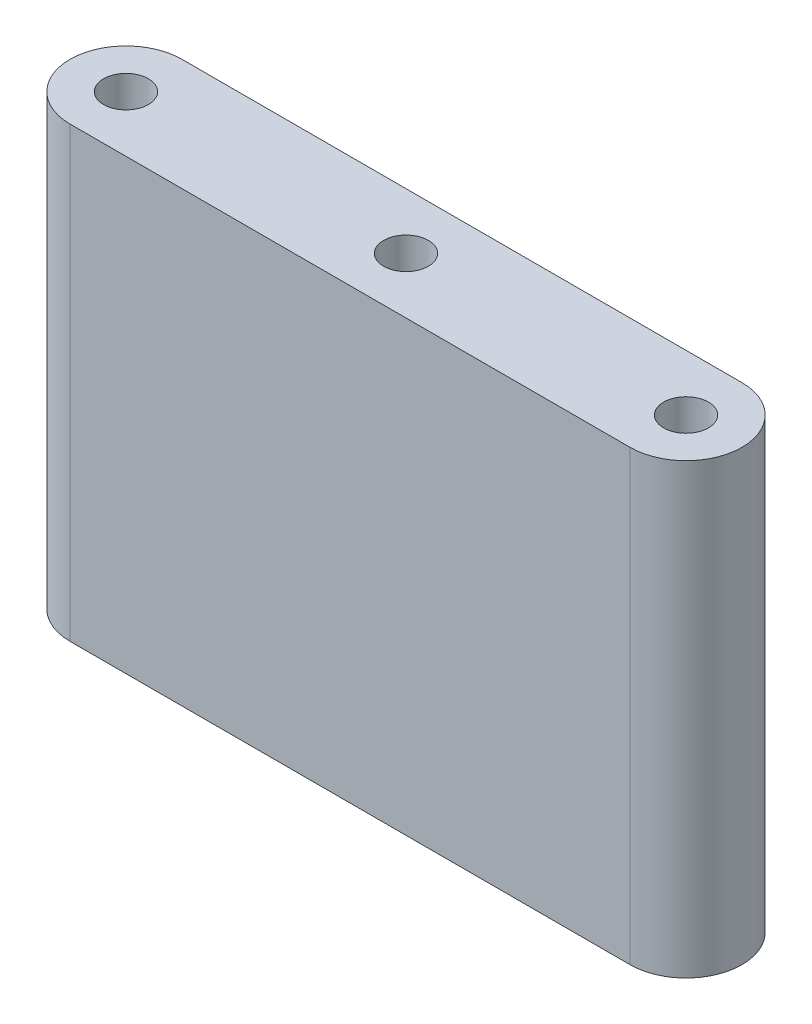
ISO-10303-21;
HEADER;
FILE_DESCRIPTION(('STEP AP214'),'2;1');
FILE_NAME('part.step','',(''),(''),'','','');
FILE_SCHEMA(('AUTOMOTIVE_DESIGN { 1 0 10303 214 1 1 1 1 }'));
ENDSEC;
DATA;
#1=APPLICATION_CONTEXT('core data for automotive mechanical design processes');
#2=APPLICATION_PROTOCOL_DEFINITION('international standard','automotive_design',2000,#1);
#3=PRODUCT_CONTEXT('',#1,'mechanical');
#4=PRODUCT('Part','Part','',(#3));
#5=PRODUCT_RELATED_PRODUCT_CATEGORY('part','',(#4));
#6=PRODUCT_DEFINITION_FORMATION('','',#4);
#7=PRODUCT_DEFINITION_CONTEXT('part definition',#1,'design');
#8=PRODUCT_DEFINITION('design','',#6,#7);
#9=PRODUCT_DEFINITION_SHAPE('','',#8);
#10=(LENGTH_UNIT() NAMED_UNIT(*) SI_UNIT(.MILLI.,.METRE.));
#11=(NAMED_UNIT(*) PLANE_ANGLE_UNIT() SI_UNIT($,.RADIAN.));
#12=(NAMED_UNIT(*) SI_UNIT($,.STERADIAN.) SOLID_ANGLE_UNIT());
#13=UNCERTAINTY_MEASURE_WITH_UNIT(LENGTH_MEASURE(1.E-05),#10,'distance_accuracy_value','');
#14=(GEOMETRIC_REPRESENTATION_CONTEXT(3) GLOBAL_UNCERTAINTY_ASSIGNED_CONTEXT((#13)) GLOBAL_UNIT_ASSIGNED_CONTEXT((#10,
#11,#12)) REPRESENTATION_CONTEXT('',''));
#15=CARTESIAN_POINT('',(0.,0.,0.));
#16=DIRECTION('',(0.,0.,1.));
#17=DIRECTION('',(1.,0.,0.));
#18=AXIS2_PLACEMENT_3D('',#15,#16,#17);
#19=CARTESIAN_POINT('',(0.,16.,0.));
#20=DIRECTION('',(0.,1.,0.));
#21=DIRECTION('',(0.,0.,1.));
#22=AXIS2_PLACEMENT_3D('',#19,#20,#21);
#23=PLANE('',#22);
#24=CARTESIAN_POINT('',(20.,16.,0.));
#25=DIRECTION('',(0.,1.,0.));
#26=DIRECTION('',(0.,0.,1.));
#27=AXIS2_PLACEMENT_3D('',#24,#25,#26);
#28=CIRCLE('',#27,1.6);
#29=CARTESIAN_POINT('',(20.,16.,1.6));
#30=VERTEX_POINT('',#29);
#31=EDGE_CURVE('E239',#30,#30,#28,.T.);
#32=ORIENTED_EDGE('',*,*,#31,.F.);
#33=EDGE_LOOP('',(#32));
#34=FACE_BOUND('',#33,.T.);
#35=CARTESIAN_POINT('',(0.,16.,0.));
#36=DIRECTION('',(0.,1.,0.));
#37=DIRECTION('',(0.,0.,1.));
#38=AXIS2_PLACEMENT_3D('',#35,#36,#37);
#39=CIRCLE('',#38,4.);
#40=CARTESIAN_POINT('',(0.,16.,-4.));
#41=VERTEX_POINT('',#40);
#42=CARTESIAN_POINT('',(0.,16.,4.));
#43=VERTEX_POINT('',#42);
#44=EDGE_CURVE('E139',#41,#43,#39,.T.);
#45=ORIENTED_EDGE('',*,*,#44,.T.);
#46=DIRECTION('',(1.,0.,0.));
#47=VECTOR('',#46,1.);
#48=CARTESIAN_POINT('',(0.,16.,4.));
#49=LINE('',#48,#47);
#50=CARTESIAN_POINT('',(40.,16.,4.));
#51=VERTEX_POINT('',#50);
#52=EDGE_CURVE('E129',#43,#51,#49,.T.);
#53=ORIENTED_EDGE('',*,*,#52,.T.);
#54=CARTESIAN_POINT('',(40.,16.,0.));
#55=DIRECTION('',(0.,1.,0.));
#56=DIRECTION('',(0.,0.,1.));
#57=AXIS2_PLACEMENT_3D('',#54,#55,#56);
#58=CIRCLE('',#57,4.);
#59=CARTESIAN_POINT('',(40.,16.,-4.));
#60=VERTEX_POINT('',#59);
#61=EDGE_CURVE('E138',#51,#60,#58,.T.);
#62=ORIENTED_EDGE('',*,*,#61,.T.);
#63=DIRECTION('',(-1.,0.,0.));
#64=VECTOR('',#63,1.);
#65=CARTESIAN_POINT('',(0.,16.,-4.));
#66=LINE('',#65,#64);
#67=EDGE_CURVE('E144',#60,#41,#66,.T.);
#68=ORIENTED_EDGE('',*,*,#67,.T.);
#69=EDGE_LOOP('',(#45,#53,#62,#68));
#70=FACE_BOUND('',#69,.T.);
#71=CARTESIAN_POINT('',(0.,16.,0.));
#72=DIRECTION('',(0.,1.,0.));
#73=DIRECTION('',(0.,0.,1.));
#74=AXIS2_PLACEMENT_3D('',#71,#72,#73);
#75=CIRCLE('',#74,1.6);
#76=CARTESIAN_POINT('',(0.,16.,1.6));
#77=VERTEX_POINT('',#76);
#78=EDGE_CURVE('E245',#77,#77,#75,.T.);
#79=ORIENTED_EDGE('',*,*,#78,.F.);
#80=EDGE_LOOP('',(#79));
#81=FACE_BOUND('',#80,.T.);
#82=CARTESIAN_POINT('',(40.,16.,0.));
#83=DIRECTION('',(0.,1.,0.));
#84=DIRECTION('',(0.,0.,1.));
#85=AXIS2_PLACEMENT_3D('',#82,#83,#84);
#86=CIRCLE('',#85,1.60000000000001);
#87=CARTESIAN_POINT('',(40.,16.,1.60000000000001));
#88=VERTEX_POINT('',#87);
#89=EDGE_CURVE('E233',#88,#88,#86,.T.);
#90=ORIENTED_EDGE('',*,*,#89,.F.);
#91=EDGE_LOOP('',(#90));
#92=FACE_BOUND('',#91,.T.);
#93=ADVANCED_FACE('F41',(#34,#70,#81,#92),#23,.T.);
#94=CARTESIAN_POINT('',(0.,-16.,0.));
#95=DIRECTION('',(0.,1.,0.));
#96=DIRECTION('',(0.,0.,1.));
#97=AXIS2_PLACEMENT_3D('',#94,#95,#96);
#98=PLANE('',#97);
#99=DIRECTION('',(0.,0.,-1.));
#100=VECTOR('',#99,1.);
#101=CARTESIAN_POINT('',(-4.,-16.,-16.3992561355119));
#102=LINE('',#101,#100);
#103=CARTESIAN_POINT('',(-4.,-16.,0.));
#104=VERTEX_POINT('',#103);
#105=CARTESIAN_POINT('',(-4.,-16.,-16.));
#106=VERTEX_POINT('',#105);
#107=EDGE_CURVE('E222',#104,#106,#102,.T.);
#108=ORIENTED_EDGE('',*,*,#107,.T.);
#109=CARTESIAN_POINT('',(-1.,-16.,-16.));
#110=DIRECTION('',(0.,1.,0.));
#111=DIRECTION('',(0.,0.,1.));
#112=AXIS2_PLACEMENT_3D('',#109,#110,#111);
#113=CIRCLE('',#112,3.);
#114=CARTESIAN_POINT('',(-3.89557916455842,-16.,-16.7846153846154));
#115=VERTEX_POINT('',#114);
#116=EDGE_CURVE('E175',#106,#115,#113,.F.);
#117=ORIENTED_EDGE('',*,*,#116,.T.);
#118=DIRECTION('',(0.261538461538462,0.,-0.965193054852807));
#119=VECTOR('',#118,1.);
#120=CARTESIAN_POINT('',(-1.59527616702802,-16.,-25.2737548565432));
#121=LINE('',#120,#119);
#122=CARTESIAN_POINT('',(-2.19557916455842,-16.,-23.0583702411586));
#123=VERTEX_POINT('',#122);
#124=EDGE_CURVE('E224',#115,#123,#121,.T.);
#125=ORIENTED_EDGE('',*,*,#124,.T.);
#126=CARTESIAN_POINT('',(0.700000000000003,-16.,-22.2737548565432));
#127=DIRECTION('',(0.,1.,0.));
#128=DIRECTION('',(0.,0.,1.));
#129=AXIS2_PLACEMENT_3D('',#126,#127,#128);
#130=CIRCLE('',#129,3.);
#131=CARTESIAN_POINT('',(0.700000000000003,-16.,-25.2737548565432));
#132=VERTEX_POINT('',#131);
#133=EDGE_CURVE('E171',#123,#132,#130,.F.);
#134=ORIENTED_EDGE('',*,*,#133,.T.);
#135=CARTESIAN_POINT('',(0.700000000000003,-16.,-22.2737548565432));
#136=DIRECTION('',(0.,1.,0.));
#137=DIRECTION('',(0.,0.,1.));
#138=AXIS2_PLACEMENT_3D('',#135,#136,#137);
#139=CIRCLE('',#138,3.);
#140=CARTESIAN_POINT('',(3.44688052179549,-16.,-23.4798424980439));
#141=VERTEX_POINT('',#140);
#142=EDGE_CURVE('E173',#132,#141,#139,.F.);
#143=ORIENTED_EDGE('',*,*,#142,.T.);
#144=DIRECTION('',(0.402029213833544,0.,0.915626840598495));
#145=VECTOR('',#144,1.);
#146=CARTESIAN_POINT('',(2.65921775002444,-16.,-25.2737548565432));
#147=LINE('',#146,#145);
#148=CARTESIAN_POINT('',(11.212337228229,-16.,-5.79391235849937));
#149=VERTEX_POINT('',#148);
#150=EDGE_CURVE('E194',#141,#149,#147,.T.);
#151=ORIENTED_EDGE('',*,*,#150,.T.);
#152=CARTESIAN_POINT('',(13.9592177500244,-16.,-7.));
#153=DIRECTION('',(0.,1.,0.));
#154=DIRECTION('',(0.,0.,1.));
#155=AXIS2_PLACEMENT_3D('',#152,#153,#154);
#156=CIRCLE('',#155,3.);
#157=CARTESIAN_POINT('',(13.9592177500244,-16.,-4.));
#158=VERTEX_POINT('',#157);
#159=EDGE_CURVE('E50',#149,#158,#156,.T.);
#160=ORIENTED_EDGE('',*,*,#159,.T.);
#161=DIRECTION('',(-1.,0.,0.));
#162=VECTOR('',#161,1.);
#163=CARTESIAN_POINT('',(0.,-16.,-4.));
#164=LINE('',#163,#162);
#165=CARTESIAN_POINT('',(40.,-16.,-4.));
#166=VERTEX_POINT('',#165);
#167=EDGE_CURVE('E148',#166,#158,#164,.T.);
#168=ORIENTED_EDGE('',*,*,#167,.F.);
#169=CARTESIAN_POINT('',(40.,-16.,0.));
#170=DIRECTION('',(0.,1.,0.));
#171=DIRECTION('',(0.,0.,1.));
#172=AXIS2_PLACEMENT_3D('',#169,#170,#171);
#173=CIRCLE('',#172,4.);
#174=CARTESIAN_POINT('',(40.,-16.,4.));
#175=VERTEX_POINT('',#174);
#176=EDGE_CURVE('E203',#175,#166,#173,.T.);
#177=ORIENTED_EDGE('',*,*,#176,.F.);
#178=DIRECTION('',(1.,0.,0.));
#179=VECTOR('',#178,1.);
#180=CARTESIAN_POINT('',(0.,-16.,4.));
#181=LINE('',#180,#179);
#182=CARTESIAN_POINT('',(0.,-16.,4.));
#183=VERTEX_POINT('',#182);
#184=EDGE_CURVE('E254',#183,#175,#181,.T.);
#185=ORIENTED_EDGE('',*,*,#184,.F.);
#186=CARTESIAN_POINT('',(0.,-16.,0.));
#187=DIRECTION('',(0.,1.,0.));
#188=DIRECTION('',(0.,0.,1.));
#189=AXIS2_PLACEMENT_3D('',#186,#187,#188);
#190=CIRCLE('',#189,4.);
#191=EDGE_CURVE('E152',#104,#183,#190,.T.);
#192=ORIENTED_EDGE('',*,*,#191,.F.);
#193=EDGE_LOOP('',(#108,#117,#125,#134,#143,#151,#160,#168,#177,#185,#192));
#194=FACE_BOUND('',#193,.T.);
#195=CARTESIAN_POINT('',(0.,-16.,0.));
#196=DIRECTION('',(0.,1.,0.));
#197=DIRECTION('',(0.,0.,1.));
#198=AXIS2_PLACEMENT_3D('',#195,#196,#197);
#199=CIRCLE('',#198,1.6);
#200=CARTESIAN_POINT('',(0.,-16.,1.6));
#201=VERTEX_POINT('',#200);
#202=EDGE_CURVE('E242',#201,#201,#199,.T.);
#203=ORIENTED_EDGE('',*,*,#202,.T.);
#204=EDGE_LOOP('',(#203));
#205=FACE_BOUND('',#204,.T.);
#206=CARTESIAN_POINT('',(20.,-16.,0.));
#207=DIRECTION('',(0.,1.,0.));
#208=DIRECTION('',(0.,0.,1.));
#209=AXIS2_PLACEMENT_3D('',#206,#207,#208);
#210=CIRCLE('',#209,1.6);
#211=CARTESIAN_POINT('',(20.,-16.,1.6));
#212=VERTEX_POINT('',#211);
#213=EDGE_CURVE('E236',#212,#212,#210,.T.);
#214=ORIENTED_EDGE('',*,*,#213,.T.);
#215=EDGE_LOOP('',(#214));
#216=FACE_BOUND('',#215,.T.);
#217=CARTESIAN_POINT('',(40.,-16.,0.));
#218=DIRECTION('',(0.,1.,0.));
#219=DIRECTION('',(0.,0.,1.));
#220=AXIS2_PLACEMENT_3D('',#217,#218,#219);
#221=CIRCLE('',#220,1.60000000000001);
#222=CARTESIAN_POINT('',(40.,-16.,1.60000000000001));
#223=VERTEX_POINT('',#222);
#224=EDGE_CURVE('E232',#223,#223,#221,.T.);
#225=ORIENTED_EDGE('',*,*,#224,.T.);
#226=EDGE_LOOP('',(#225));
#227=FACE_BOUND('',#226,.T.);
#228=CARTESIAN_POINT('',(0.700000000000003,-16.,-22.2737548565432));
#229=DIRECTION('',(0.,-1.,0.));
#230=DIRECTION('',(0.,0.,-1.));
#231=AXIS2_PLACEMENT_3D('',#228,#229,#230);
#232=CIRCLE('',#231,1.1);
#233=CARTESIAN_POINT('',(0.700000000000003,-16.,-23.3737548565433));
#234=VERTEX_POINT('',#233);
#235=EDGE_CURVE('E264',#234,#234,#232,.T.);
#236=ORIENTED_EDGE('',*,*,#235,.F.);
#237=EDGE_LOOP('',(#236));
#238=FACE_BOUND('',#237,.T.);
#239=CARTESIAN_POINT('',(-0.999999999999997,-16.,-16.));
#240=DIRECTION('',(0.,-1.,0.));
#241=DIRECTION('',(0.,0.,-1.));
#242=AXIS2_PLACEMENT_3D('',#239,#240,#241);
#243=CIRCLE('',#242,1.1);
#244=CARTESIAN_POINT('',(-0.999999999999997,-16.,-17.1));
#245=VERTEX_POINT('',#244);
#246=EDGE_CURVE('E270',#245,#245,#243,.T.);
#247=ORIENTED_EDGE('',*,*,#246,.F.);
#248=EDGE_LOOP('',(#247));
#249=FACE_BOUND('',#248,.T.);
#250=ADVANCED_FACE('F190',(#194,#205,#216,#227,#238,#249),#98,.F.);
#251=CARTESIAN_POINT('',(0.,16.,0.));
#252=DIRECTION('',(0.,-1.,0.));
#253=DIRECTION('',(0.,0.,-1.));
#254=AXIS2_PLACEMENT_3D('',#251,#252,#253);
#255=CYLINDRICAL_SURFACE('',#254,4.);
#256=CARTESIAN_POINT('',(0.,-8.,0.));
#257=DIRECTION('',(0.,-1.,0.));
#258=DIRECTION('',(0.,0.,-1.));
#259=AXIS2_PLACEMENT_3D('',#256,#257,#258);
#260=CIRCLE('',#259,4.);
#261=CARTESIAN_POINT('',(-4.,-8.,0.));
#262=VERTEX_POINT('',#261);
#263=CARTESIAN_POINT('',(0.,-8.,-4.));
#264=VERTEX_POINT('',#263);
#265=EDGE_CURVE('E230',#262,#264,#260,.T.);
#266=ORIENTED_EDGE('',*,*,#265,.F.);
#267=DIRECTION('',(0.,-1.,0.));
#268=VECTOR('',#267,1.);
#269=CARTESIAN_POINT('',(-4.,-8.,0.));
#270=LINE('',#269,#268);
#271=EDGE_CURVE('E216',#262,#104,#270,.T.);
#272=ORIENTED_EDGE('',*,*,#271,.T.);
#273=ORIENTED_EDGE('',*,*,#191,.T.);
#274=DIRECTION('',(0.,-1.,0.));
#275=VECTOR('',#274,1.);
#276=CARTESIAN_POINT('',(0.,16.,4.));
#277=LINE('',#276,#275);
#278=EDGE_CURVE('E133',#43,#183,#277,.T.);
#279=ORIENTED_EDGE('',*,*,#278,.F.);
#280=ORIENTED_EDGE('',*,*,#44,.F.);
#281=DIRECTION('',(0.,-1.,0.));
#282=VECTOR('',#281,1.);
#283=CARTESIAN_POINT('',(0.,16.,-4.));
#284=LINE('',#283,#282);
#285=EDGE_CURVE('E252',#41,#264,#284,.T.);
#286=ORIENTED_EDGE('',*,*,#285,.T.);
#287=EDGE_LOOP('',(#266,#272,#273,#279,#280,#286));
#288=FACE_BOUND('',#287,.T.);
#289=ADVANCED_FACE('F150',(#288),#255,.T.);
#290=CARTESIAN_POINT('',(0.,16.,4.));
#291=DIRECTION('',(0.,0.,-1.));
#292=DIRECTION('',(-1.,0.,0.));
#293=AXIS2_PLACEMENT_3D('',#290,#291,#292);
#294=PLANE('',#293);
#295=ORIENTED_EDGE('',*,*,#184,.T.);
#296=DIRECTION('',(0.,-1.,0.));
#297=VECTOR('',#296,1.);
#298=CARTESIAN_POINT('',(40.,16.,4.));
#299=LINE('',#298,#297);
#300=EDGE_CURVE('E135',#51,#175,#299,.T.);
#301=ORIENTED_EDGE('',*,*,#300,.F.);
#302=ORIENTED_EDGE('',*,*,#52,.F.);
#303=ORIENTED_EDGE('',*,*,#278,.T.);
#304=EDGE_LOOP('',(#295,#301,#302,#303));
#305=FACE_BOUND('',#304,.T.);
#306=ADVANCED_FACE('F131',(#305),#294,.F.);
#307=CARTESIAN_POINT('',(40.,16.,0.));
#308=DIRECTION('',(0.,-1.,0.));
#309=DIRECTION('',(0.,0.,-1.));
#310=AXIS2_PLACEMENT_3D('',#307,#308,#309);
#311=CYLINDRICAL_SURFACE('',#310,4.);
#312=ORIENTED_EDGE('',*,*,#176,.T.);
#313=DIRECTION('',(0.,-1.,0.));
#314=VECTOR('',#313,1.);
#315=CARTESIAN_POINT('',(40.,16.,-4.));
#316=LINE('',#315,#314);
#317=EDGE_CURVE('E159',#60,#166,#316,.T.);
#318=ORIENTED_EDGE('',*,*,#317,.F.);
#319=ORIENTED_EDGE('',*,*,#61,.F.);
#320=ORIENTED_EDGE('',*,*,#300,.T.);
#321=EDGE_LOOP('',(#312,#318,#319,#320));
#322=FACE_BOUND('',#321,.T.);
#323=ADVANCED_FACE('F299',(#322),#311,.T.);
#324=CARTESIAN_POINT('',(0.,16.,-4.));
#325=DIRECTION('',(0.,0.,1.));
#326=DIRECTION('',(1.,0.,0.));
#327=AXIS2_PLACEMENT_3D('',#324,#325,#326);
#328=PLANE('',#327);
#329=ORIENTED_EDGE('',*,*,#167,.T.);
#330=DIRECTION('',(0.,-1.,0.));
#331=VECTOR('',#330,1.);
#332=CARTESIAN_POINT('',(13.9592177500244,16.,-4.));
#333=LINE('',#332,#331);
#334=CARTESIAN_POINT('',(13.9592177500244,-8.,-4.));
#335=VERTEX_POINT('',#334);
#336=EDGE_CURVE('E165',#158,#335,#333,.F.);
#337=ORIENTED_EDGE('',*,*,#336,.T.);
#338=DIRECTION('',(-1.,0.,0.));
#339=VECTOR('',#338,1.);
#340=CARTESIAN_POINT('',(12.,-8.,-4.));
#341=LINE('',#340,#339);
#342=EDGE_CURVE('E210',#335,#264,#341,.T.);
#343=ORIENTED_EDGE('',*,*,#342,.T.);
#344=ORIENTED_EDGE('',*,*,#285,.F.);
#345=ORIENTED_EDGE('',*,*,#67,.F.);
#346=ORIENTED_EDGE('',*,*,#317,.T.);
#347=EDGE_LOOP('',(#329,#337,#343,#344,#345,#346));
#348=FACE_BOUND('',#347,.T.);
#349=ADVANCED_FACE('F200',(#348),#328,.F.);
#350=CARTESIAN_POINT('',(0.,16.,0.));
#351=DIRECTION('',(0.,-1.,0.));
#352=DIRECTION('',(0.,0.,-1.));
#353=AXIS2_PLACEMENT_3D('',#350,#351,#352);
#354=CYLINDRICAL_SURFACE('',#353,1.6);
#355=ORIENTED_EDGE('',*,*,#78,.T.);
#356=EDGE_LOOP('',(#355));
#357=FACE_BOUND('',#356,.T.);
#358=ORIENTED_EDGE('',*,*,#202,.F.);
#359=EDGE_LOOP('',(#358));
#360=FACE_BOUND('',#359,.T.);
#361=ADVANCED_FACE('F298',(#357,#360),#354,.F.);
#362=CARTESIAN_POINT('',(20.,16.,0.));
#363=DIRECTION('',(0.,-1.,0.));
#364=DIRECTION('',(0.,0.,-1.));
#365=AXIS2_PLACEMENT_3D('',#362,#363,#364);
#366=CYLINDRICAL_SURFACE('',#365,1.6);
#367=ORIENTED_EDGE('',*,*,#31,.T.);
#368=EDGE_LOOP('',(#367));
#369=FACE_BOUND('',#368,.T.);
#370=ORIENTED_EDGE('',*,*,#213,.F.);
#371=EDGE_LOOP('',(#370));
#372=FACE_BOUND('',#371,.T.);
#373=ADVANCED_FACE('F341',(#369,#372),#366,.F.);
#374=CARTESIAN_POINT('',(40.,16.,0.));
#375=DIRECTION('',(0.,-1.,0.));
#376=DIRECTION('',(0.,0.,-1.));
#377=AXIS2_PLACEMENT_3D('',#374,#375,#376);
#378=CYLINDRICAL_SURFACE('',#377,1.60000000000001);
#379=ORIENTED_EDGE('',*,*,#89,.T.);
#380=EDGE_LOOP('',(#379));
#381=FACE_BOUND('',#380,.T.);
#382=ORIENTED_EDGE('',*,*,#224,.F.);
#383=EDGE_LOOP('',(#382));
#384=FACE_BOUND('',#383,.T.);
#385=ADVANCED_FACE('F335',(#381,#384),#378,.F.);
#386=CARTESIAN_POINT('',(0.,-8.,0.));
#387=DIRECTION('',(0.,-1.,0.));
#388=DIRECTION('',(0.,0.,-1.));
#389=AXIS2_PLACEMENT_3D('',#386,#387,#388);
#390=PLANE('',#389);
#391=CARTESIAN_POINT('',(-0.999999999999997,-8.,-16.));
#392=DIRECTION('',(0.,-1.,0.));
#393=DIRECTION('',(0.,0.,-1.));
#394=AXIS2_PLACEMENT_3D('',#391,#392,#393);
#395=CIRCLE('',#394,1.1);
#396=CARTESIAN_POINT('',(-0.999999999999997,-8.,-17.1));
#397=VERTEX_POINT('',#396);
#398=EDGE_CURVE('E267',#397,#397,#395,.T.);
#399=ORIENTED_EDGE('',*,*,#398,.T.);
#400=EDGE_LOOP('',(#399));
#401=FACE_BOUND('',#400,.T.);
#402=CARTESIAN_POINT('',(0.700000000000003,-8.,-22.2737548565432));
#403=DIRECTION('',(0.,-1.,0.));
#404=DIRECTION('',(0.,0.,-1.));
#405=AXIS2_PLACEMENT_3D('',#402,#403,#404);
#406=CIRCLE('',#405,1.1);
#407=CARTESIAN_POINT('',(0.700000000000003,-8.,-23.3737548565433));
#408=VERTEX_POINT('',#407);
#409=EDGE_CURVE('E225',#408,#408,#406,.T.);
#410=ORIENTED_EDGE('',*,*,#409,.T.);
#411=EDGE_LOOP('',(#410));
#412=FACE_BOUND('',#411,.T.);
#413=DIRECTION('',(0.261538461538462,0.,-0.965193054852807));
#414=VECTOR('',#413,1.);
#415=CARTESIAN_POINT('',(-1.59527616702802,-8.,-25.2737548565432));
#416=LINE('',#415,#414);
#417=CARTESIAN_POINT('',(-3.89557916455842,-8.,-16.7846153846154));
#418=VERTEX_POINT('',#417);
#419=CARTESIAN_POINT('',(-2.19557916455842,-8.,-23.0583702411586));
#420=VERTEX_POINT('',#419);
#421=EDGE_CURVE('E214',#418,#420,#416,.T.);
#422=ORIENTED_EDGE('',*,*,#421,.F.);
#423=CARTESIAN_POINT('',(-1.,-8.,-16.));
#424=DIRECTION('',(0.,-1.,0.));
#425=DIRECTION('',(0.,0.,-1.));
#426=AXIS2_PLACEMENT_3D('',#423,#424,#425);
#427=CIRCLE('',#426,3.);
#428=CARTESIAN_POINT('',(-4.,-8.,-16.));
#429=VERTEX_POINT('',#428);
#430=EDGE_CURVE('E183',#418,#429,#427,.F.);
#431=ORIENTED_EDGE('',*,*,#430,.T.);
#432=DIRECTION('',(0.,0.,-1.));
#433=VECTOR('',#432,1.);
#434=CARTESIAN_POINT('',(-4.,-8.,-16.3992561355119));
#435=LINE('',#434,#433);
#436=EDGE_CURVE('E218',#262,#429,#435,.T.);
#437=ORIENTED_EDGE('',*,*,#436,.F.);
#438=ORIENTED_EDGE('',*,*,#265,.T.);
#439=ORIENTED_EDGE('',*,*,#342,.F.);
#440=CARTESIAN_POINT('',(13.9592177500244,-8.,-7.));
#441=DIRECTION('',(0.,-1.,0.));
#442=DIRECTION('',(0.,0.,-1.));
#443=AXIS2_PLACEMENT_3D('',#440,#441,#442);
#444=CIRCLE('',#443,3.);
#445=CARTESIAN_POINT('',(11.212337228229,-8.,-5.79391235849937));
#446=VERTEX_POINT('',#445);
#447=EDGE_CURVE('E11',#335,#446,#444,.T.);
#448=ORIENTED_EDGE('',*,*,#447,.T.);
#449=DIRECTION('',(0.402029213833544,0.,0.915626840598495));
#450=VECTOR('',#449,1.);
#451=CARTESIAN_POINT('',(2.65921775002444,-8.,-25.2737548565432));
#452=LINE('',#451,#450);
#453=CARTESIAN_POINT('',(3.44688052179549,-8.,-23.4798424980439));
#454=VERTEX_POINT('',#453);
#455=EDGE_CURVE('E208',#454,#446,#452,.T.);
#456=ORIENTED_EDGE('',*,*,#455,.F.);
#457=CARTESIAN_POINT('',(0.700000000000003,-8.,-22.2737548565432));
#458=DIRECTION('',(0.,-1.,0.));
#459=DIRECTION('',(0.,0.,-1.));
#460=AXIS2_PLACEMENT_3D('',#457,#458,#459);
#461=CIRCLE('',#460,3.);
#462=CARTESIAN_POINT('',(0.700000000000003,-8.,-25.2737548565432));
#463=VERTEX_POINT('',#462);
#464=EDGE_CURVE('E57',#454,#463,#461,.F.);
#465=ORIENTED_EDGE('',*,*,#464,.T.);
#466=CARTESIAN_POINT('',(0.700000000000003,-8.,-22.2737548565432));
#467=DIRECTION('',(0.,-1.,0.));
#468=DIRECTION('',(0.,0.,-1.));
#469=AXIS2_PLACEMENT_3D('',#466,#467,#468);
#470=CIRCLE('',#469,3.);
#471=EDGE_CURVE('E61',#463,#420,#470,.F.);
#472=ORIENTED_EDGE('',*,*,#471,.T.);
#473=EDGE_LOOP('',(#422,#431,#437,#438,#439,#448,#456,#465,#472));
#474=FACE_BOUND('',#473,.T.);
#475=ADVANCED_FACE('F207',(#401,#412,#474),#390,.F.);
#476=CARTESIAN_POINT('',(-4.,-8.,-16.3992561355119));
#477=DIRECTION('',(-1.,0.,0.));
#478=DIRECTION('',(0.,0.,1.));
#479=AXIS2_PLACEMENT_3D('',#476,#477,#478);
#480=PLANE('',#479);
#481=ORIENTED_EDGE('',*,*,#436,.T.);
#482=DIRECTION('',(0.,-1.,0.));
#483=VECTOR('',#482,1.);
#484=CARTESIAN_POINT('',(-4.,-8.,-16.));
#485=LINE('',#484,#483);
#486=EDGE_CURVE('E168',#429,#106,#485,.T.);
#487=ORIENTED_EDGE('',*,*,#486,.T.);
#488=ORIENTED_EDGE('',*,*,#107,.F.);
#489=ORIENTED_EDGE('',*,*,#271,.F.);
#490=EDGE_LOOP('',(#481,#487,#488,#489));
#491=FACE_BOUND('',#490,.T.);
#492=ADVANCED_FACE('F327',(#491),#480,.T.);
#493=CARTESIAN_POINT('',(2.65921775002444,-8.,-25.2737548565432));
#494=DIRECTION('',(0.915626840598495,0.,-0.402029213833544));
#495=DIRECTION('',(-0.402029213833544,0.,-0.915626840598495));
#496=AXIS2_PLACEMENT_3D('',#493,#494,#495);
#497=PLANE('',#496);
#498=ORIENTED_EDGE('',*,*,#455,.T.);
#499=DIRECTION('',(0.,-1.,0.));
#500=VECTOR('',#499,1.);
#501=CARTESIAN_POINT('',(11.212337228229,-8.,-5.79391235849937));
#502=LINE('',#501,#500);
#503=EDGE_CURVE('E157',#446,#149,#502,.T.);
#504=ORIENTED_EDGE('',*,*,#503,.T.);
#505=ORIENTED_EDGE('',*,*,#150,.F.);
#506=DIRECTION('',(0.,-1.,0.));
#507=VECTOR('',#506,1.);
#508=CARTESIAN_POINT('',(3.44688052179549,-8.,-23.4798424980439));
#509=LINE('',#508,#507);
#510=EDGE_CURVE('E154',#141,#454,#509,.F.);
#511=ORIENTED_EDGE('',*,*,#510,.T.);
#512=EDGE_LOOP('',(#498,#504,#505,#511));
#513=FACE_BOUND('',#512,.T.);
#514=ADVANCED_FACE('F212',(#513),#497,.T.);
#515=CARTESIAN_POINT('',(-1.59527616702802,-8.,-25.2737548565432));
#516=DIRECTION('',(-0.965193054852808,0.,-0.261538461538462));
#517=DIRECTION('',(-0.261538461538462,0.,0.965193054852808));
#518=AXIS2_PLACEMENT_3D('',#515,#516,#517);
#519=PLANE('',#518);
#520=ORIENTED_EDGE('',*,*,#124,.F.);
#521=DIRECTION('',(0.,-1.,0.));
#522=VECTOR('',#521,1.);
#523=CARTESIAN_POINT('',(-3.89557916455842,-8.,-16.7846153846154));
#524=LINE('',#523,#522);
#525=EDGE_CURVE('E179',#115,#418,#524,.F.);
#526=ORIENTED_EDGE('',*,*,#525,.T.);
#527=ORIENTED_EDGE('',*,*,#421,.T.);
#528=DIRECTION('',(0.,-1.,0.));
#529=VECTOR('',#528,1.);
#530=CARTESIAN_POINT('',(-2.19557916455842,-8.,-23.0583702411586));
#531=LINE('',#530,#529);
#532=EDGE_CURVE('E177',#420,#123,#531,.T.);
#533=ORIENTED_EDGE('',*,*,#532,.T.);
#534=EDGE_LOOP('',(#520,#526,#527,#533));
#535=FACE_BOUND('',#534,.T.);
#536=ADVANCED_FACE('F324',(#535),#519,.T.);
#537=CARTESIAN_POINT('',(0.700000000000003,-8.,-22.2737548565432));
#538=DIRECTION('',(0.,-1.,0.));
#539=DIRECTION('',(0.,0.,-1.));
#540=AXIS2_PLACEMENT_3D('',#537,#538,#539);
#541=CYLINDRICAL_SURFACE('',#540,1.1);
#542=ORIENTED_EDGE('',*,*,#409,.F.);
#543=EDGE_LOOP('',(#542));
#544=FACE_BOUND('',#543,.T.);
#545=ORIENTED_EDGE('',*,*,#235,.T.);
#546=EDGE_LOOP('',(#545));
#547=FACE_BOUND('',#546,.T.);
#548=ADVANCED_FACE('F281',(#544,#547),#541,.F.);
#549=CARTESIAN_POINT('',(-0.999999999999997,-8.,-16.));
#550=DIRECTION('',(0.,-1.,0.));
#551=DIRECTION('',(0.,0.,-1.));
#552=AXIS2_PLACEMENT_3D('',#549,#550,#551);
#553=CYLINDRICAL_SURFACE('',#552,1.1);
#554=ORIENTED_EDGE('',*,*,#398,.F.);
#555=EDGE_LOOP('',(#554));
#556=FACE_BOUND('',#555,.T.);
#557=ORIENTED_EDGE('',*,*,#246,.T.);
#558=EDGE_LOOP('',(#557));
#559=FACE_BOUND('',#558,.T.);
#560=ADVANCED_FACE('F278',(#556,#559),#553,.F.);
#561=CARTESIAN_POINT('',(13.9592177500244,-8.,-7.));
#562=DIRECTION('',(0.,-1.,0.));
#563=DIRECTION('',(0.,0.,-1.));
#564=AXIS2_PLACEMENT_3D('',#561,#562,#563);
#565=CYLINDRICAL_SURFACE('',#564,3.);
#566=ORIENTED_EDGE('',*,*,#447,.F.);
#567=ORIENTED_EDGE('',*,*,#336,.F.);
#568=ORIENTED_EDGE('',*,*,#159,.F.);
#569=ORIENTED_EDGE('',*,*,#503,.F.);
#570=EDGE_LOOP('',(#566,#567,#568,#569));
#571=FACE_BOUND('',#570,.T.);
#572=ADVANCED_FACE('F205',(#571),#565,.F.);
#573=CARTESIAN_POINT('',(-1.,-8.,-16.));
#574=DIRECTION('',(0.,-1.,0.));
#575=DIRECTION('',(0.,0.,-1.));
#576=AXIS2_PLACEMENT_3D('',#573,#574,#575);
#577=CYLINDRICAL_SURFACE('',#576,3.);
#578=ORIENTED_EDGE('',*,*,#430,.F.);
#579=ORIENTED_EDGE('',*,*,#525,.F.);
#580=ORIENTED_EDGE('',*,*,#116,.F.);
#581=ORIENTED_EDGE('',*,*,#486,.F.);
#582=EDGE_LOOP('',(#578,#579,#580,#581));
#583=FACE_BOUND('',#582,.T.);
#584=ADVANCED_FACE('F307',(#583),#577,.T.);
#585=CARTESIAN_POINT('',(0.700000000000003,-8.,-22.2737548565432));
#586=DIRECTION('',(0.,-1.,0.));
#587=DIRECTION('',(0.,0.,-1.));
#588=AXIS2_PLACEMENT_3D('',#585,#586,#587);
#589=CYLINDRICAL_SURFACE('',#588,3.);
#590=ORIENTED_EDGE('',*,*,#532,.F.);
#591=ORIENTED_EDGE('',*,*,#471,.F.);
#592=DIRECTION('',(0.,-1.,0.));
#593=VECTOR('',#592,1.);
#594=CARTESIAN_POINT('',(0.700000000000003,-8.,-25.2737548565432));
#595=LINE('',#594,#593);
#596=EDGE_CURVE('E45',#132,#463,#595,.F.);
#597=ORIENTED_EDGE('',*,*,#596,.F.);
#598=ORIENTED_EDGE('',*,*,#133,.F.);
#599=EDGE_LOOP('',(#590,#591,#597,#598));
#600=FACE_BOUND('',#599,.T.);
#601=ADVANCED_FACE('F43',(#600),#589,.T.);
#602=CARTESIAN_POINT('',(0.700000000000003,-8.,-22.2737548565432));
#603=DIRECTION('',(0.,-1.,0.));
#604=DIRECTION('',(0.,0.,-1.));
#605=AXIS2_PLACEMENT_3D('',#602,#603,#604);
#606=CYLINDRICAL_SURFACE('',#605,3.);
#607=ORIENTED_EDGE('',*,*,#464,.F.);
#608=ORIENTED_EDGE('',*,*,#510,.F.);
#609=ORIENTED_EDGE('',*,*,#142,.F.);
#610=ORIENTED_EDGE('',*,*,#596,.T.);
#611=EDGE_LOOP('',(#607,#608,#609,#610));
#612=FACE_BOUND('',#611,.T.);
#613=ADVANCED_FACE('F310',(#612),#606,.T.);
#614=CLOSED_SHELL('',(#93,#250,#289,#306,#323,#349,#361,#373,#385,#475,#492,#514,#536,#548,#560,
#572,#584,#601,#613));
#615=MANIFOLD_SOLID_BREP('B2',#614);
#616=ADVANCED_BREP_SHAPE_REPRESENTATION('',(#18,#615),#14);
#617=SHAPE_DEFINITION_REPRESENTATION(#9,#616);
ENDSEC;
END-ISO-10303-21;
